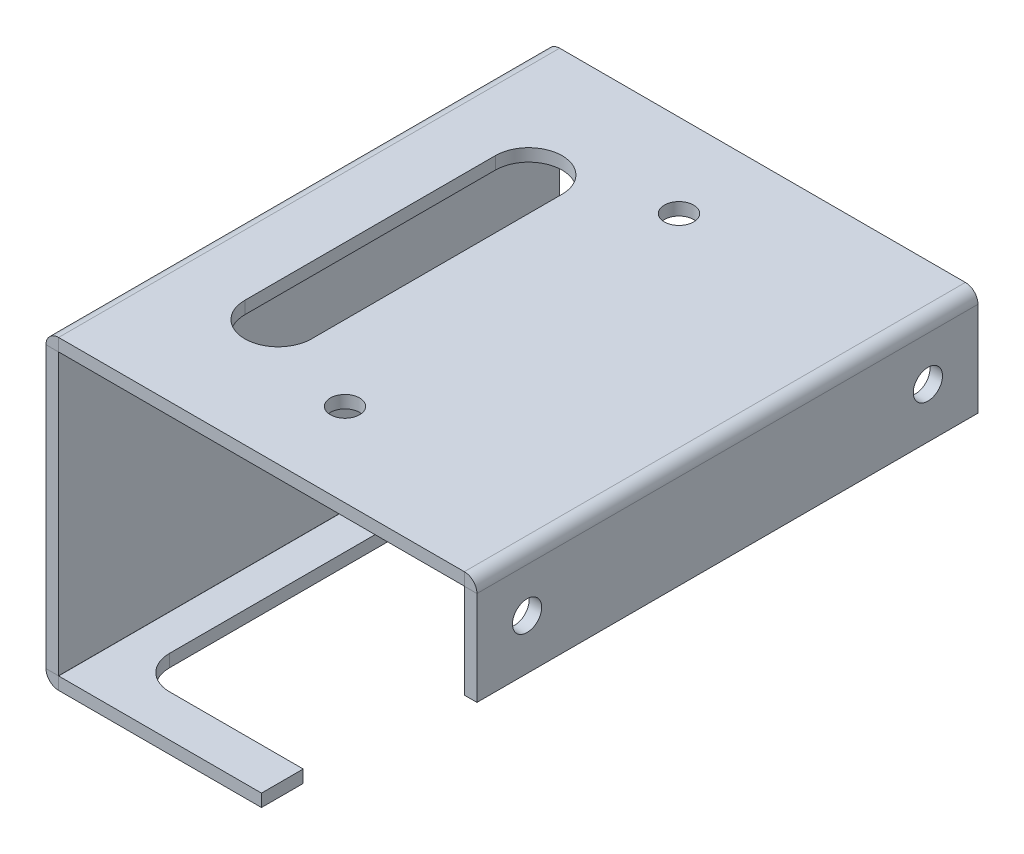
ISO-10303-21;
HEADER;
FILE_DESCRIPTION(('STEP AP214'),'2;1');
FILE_NAME('part.step','',(''),(''),'','','');
FILE_SCHEMA(('AUTOMOTIVE_DESIGN { 1 0 10303 214 1 1 1 1 }'));
ENDSEC;
DATA;
#1=APPLICATION_CONTEXT('core data for automotive mechanical design processes');
#2=APPLICATION_PROTOCOL_DEFINITION('international standard','automotive_design',2000,#1);
#3=PRODUCT_CONTEXT('',#1,'mechanical');
#4=PRODUCT('Part','Part','',(#3));
#5=PRODUCT_RELATED_PRODUCT_CATEGORY('part','',(#4));
#6=PRODUCT_DEFINITION_FORMATION('','',#4);
#7=PRODUCT_DEFINITION_CONTEXT('part definition',#1,'design');
#8=PRODUCT_DEFINITION('design','',#6,#7);
#9=PRODUCT_DEFINITION_SHAPE('','',#8);
#10=(LENGTH_UNIT() NAMED_UNIT(*) SI_UNIT(.MILLI.,.METRE.));
#11=(NAMED_UNIT(*) PLANE_ANGLE_UNIT() SI_UNIT($,.RADIAN.));
#12=(NAMED_UNIT(*) SI_UNIT($,.STERADIAN.) SOLID_ANGLE_UNIT());
#13=UNCERTAINTY_MEASURE_WITH_UNIT(LENGTH_MEASURE(1.E-05),#10,'distance_accuracy_value','');
#14=(GEOMETRIC_REPRESENTATION_CONTEXT(3) GLOBAL_UNCERTAINTY_ASSIGNED_CONTEXT((#13)) GLOBAL_UNIT_ASSIGNED_CONTEXT((#10,
#11,#12)) REPRESENTATION_CONTEXT('',''));
#15=CARTESIAN_POINT('',(0.,0.,0.));
#16=DIRECTION('',(0.,0.,1.));
#17=DIRECTION('',(1.,0.,0.));
#18=AXIS2_PLACEMENT_3D('',#15,#16,#17);
#19=CARTESIAN_POINT('',(59.1964656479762,-59.303534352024,-60.));
#20=DIRECTION('',(0.,0.,1.));
#21=DIRECTION('',(0.,1.,0.));
#22=AXIS2_PLACEMENT_3D('',#19,#20,#21);
#23=PLANE('',#22);
#24=DIRECTION('',(0.,-1.,0.));
#25=VECTOR('',#24,1.);
#26=CARTESIAN_POINT('',(60.6964656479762,-59.303534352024,-60.));
#27=LINE('',#26,#25);
#28=CARTESIAN_POINT('',(60.6964656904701,-0.0100000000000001,-60.));
#29=VERTEX_POINT('',#28);
#30=CARTESIAN_POINT('',(60.6964656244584,-33.597068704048,-60.));
#31=VERTEX_POINT('',#30);
#32=EDGE_CURVE('E474',#29,#31,#27,.T.);
#33=ORIENTED_EDGE('',*,*,#32,.T.);
#34=DIRECTION('',(-1.,0.,0.));
#35=VECTOR('',#34,1.);
#36=CARTESIAN_POINT('',(59.1964656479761,-33.597068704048,-60.));
#37=LINE('',#36,#35);
#38=CARTESIAN_POINT('',(59.1964656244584,-33.597068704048,-60.));
#39=VERTEX_POINT('',#38);
#40=EDGE_CURVE('E467',#31,#39,#37,.T.);
#41=ORIENTED_EDGE('',*,*,#40,.T.);
#42=DIRECTION('',(0.,-1.,0.));
#43=VECTOR('',#42,1.);
#44=CARTESIAN_POINT('',(59.1964656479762,-59.303534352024,-60.));
#45=LINE('',#44,#43);
#46=CARTESIAN_POINT('',(59.196465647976,-0.0100000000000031,-60.));
#47=VERTEX_POINT('',#46);
#48=EDGE_CURVE('E459',#47,#39,#45,.T.);
#49=ORIENTED_EDGE('',*,*,#48,.F.);
#50=DIRECTION('',(-1.,0.,0.));
#51=VECTOR('',#50,1.);
#52=CARTESIAN_POINT('',(59.196465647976,-0.00999999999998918,-60.));
#53=LINE('',#52,#51);
#54=EDGE_CURVE('E463',#29,#47,#53,.T.);
#55=ORIENTED_EDGE('',*,*,#54,.F.);
#56=EDGE_LOOP('',(#33,#41,#49,#55));
#57=FACE_BOUND('',#56,.T.);
#58=ADVANCED_FACE('F46',(#57),#23,.F.);
#59=CARTESIAN_POINT('',(59.1964656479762,-59.303534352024,0.));
#60=DIRECTION('',(0.,0.,-1.));
#61=DIRECTION('',(0.,-1.,0.));
#62=AXIS2_PLACEMENT_3D('',#59,#60,#61);
#63=PLANE('',#62);
#64=DIRECTION('',(0.,1.,0.));
#65=VECTOR('',#64,1.);
#66=CARTESIAN_POINT('',(59.1964656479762,-59.303534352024,0.));
#67=LINE('',#66,#65);
#68=CARTESIAN_POINT('',(59.1964656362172,-33.597068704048,0.));
#69=VERTEX_POINT('',#68);
#70=CARTESIAN_POINT('',(59.1964656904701,-0.0100000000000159,0.));
#71=VERTEX_POINT('',#70);
#72=EDGE_CURVE('E50',#69,#71,#67,.T.);
#73=ORIENTED_EDGE('',*,*,#72,.F.);
#74=DIRECTION('',(1.,0.,0.));
#75=VECTOR('',#74,1.);
#76=CARTESIAN_POINT('',(59.1964656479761,-33.597068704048,0.));
#77=LINE('',#76,#75);
#78=CARTESIAN_POINT('',(60.6964656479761,-33.597068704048,0.));
#79=VERTEX_POINT('',#78);
#80=EDGE_CURVE('E12',#69,#79,#77,.T.);
#81=ORIENTED_EDGE('',*,*,#80,.T.);
#82=DIRECTION('',(0.,1.,0.));
#83=VECTOR('',#82,1.);
#84=CARTESIAN_POINT('',(60.6964656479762,-59.303534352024,0.));
#85=LINE('',#84,#83);
#86=CARTESIAN_POINT('',(60.6964656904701,-0.0100000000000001,0.));
#87=VERTEX_POINT('',#86);
#88=EDGE_CURVE('E328',#79,#87,#85,.T.);
#89=ORIENTED_EDGE('',*,*,#88,.T.);
#90=DIRECTION('',(1.,0.,0.));
#91=VECTOR('',#90,1.);
#92=CARTESIAN_POINT('',(59.196465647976,-0.00999999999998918,0.));
#93=LINE('',#92,#91);
#94=EDGE_CURVE('E458',#71,#87,#93,.T.);
#95=ORIENTED_EDGE('',*,*,#94,.F.);
#96=EDGE_LOOP('',(#73,#81,#89,#95));
#97=FACE_BOUND('',#96,.T.);
#98=ADVANCED_FACE('F48',(#97),#63,.F.);
#99=CARTESIAN_POINT('',(60.6964656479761,-43.303534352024,-9.));
#100=DIRECTION('',(-1.,0.,0.));
#101=DIRECTION('',(0.,0.,1.));
#102=AXIS2_PLACEMENT_3D('',#99,#100,#101);
#103=PLANE('',#102);
#104=ORIENTED_EDGE('',*,*,#88,.F.);
#105=DIRECTION('',(0.,0.,-1.));
#106=VECTOR('',#105,1.);
#107=CARTESIAN_POINT('',(60.6964656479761,-33.597068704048,-9.));
#108=LINE('',#107,#106);
#109=EDGE_CURVE('E55',#79,#31,#108,.T.);
#110=ORIENTED_EDGE('',*,*,#109,.T.);
#111=ORIENTED_EDGE('',*,*,#32,.F.);
#112=DIRECTION('',(0.,0.,-1.));
#113=VECTOR('',#112,1.);
#114=CARTESIAN_POINT('',(60.696465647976,-0.00999999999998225,-9.));
#115=LINE('',#114,#113);
#116=EDGE_CURVE('E461',#87,#29,#115,.T.);
#117=ORIENTED_EDGE('',*,*,#116,.F.);
#118=EDGE_LOOP('',(#104,#110,#111,#117));
#119=FACE_BOUND('',#118,.T.);
#120=ADVANCED_FACE('F576',(#119),#103,.F.);
#121=CARTESIAN_POINT('',(59.1964656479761,-43.303534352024,-9.));
#122=DIRECTION('',(-1.,0.,0.));
#123=DIRECTION('',(0.,0.,1.));
#124=AXIS2_PLACEMENT_3D('',#121,#122,#123);
#125=PLANE('',#124);
#126=DIRECTION('',(0.,0.,-1.));
#127=VECTOR('',#126,1.);
#128=CARTESIAN_POINT('',(59.1964656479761,-33.597068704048,-9.));
#129=LINE('',#128,#127);
#130=EDGE_CURVE('E465',#69,#39,#129,.T.);
#131=ORIENTED_EDGE('',*,*,#130,.F.);
#132=ORIENTED_EDGE('',*,*,#72,.T.);
#133=DIRECTION('',(0.,0.,-1.));
#134=VECTOR('',#133,1.);
#135=CARTESIAN_POINT('',(59.196465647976,-0.00999999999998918,-9.));
#136=LINE('',#135,#134);
#137=EDGE_CURVE('E455',#71,#47,#136,.T.);
#138=ORIENTED_EDGE('',*,*,#137,.T.);
#139=ORIENTED_EDGE('',*,*,#48,.T.);
#140=EDGE_LOOP('',(#131,#132,#138,#139));
#141=FACE_BOUND('',#140,.T.);
#142=ADVANCED_FACE('F483',(#141),#125,.T.);
#143=CARTESIAN_POINT('',(110.803534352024,-5.30353435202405,-6.));
#144=DIRECTION('',(-1.,0.,0.));
#145=DIRECTION('',(0.,0.,-1.));
#146=AXIS2_PLACEMENT_3D('',#143,#144,#145);
#147=CYLINDRICAL_SURFACE('',#146,1.75);
#148=CARTESIAN_POINT('',(110.803534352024,-5.30353435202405,-6.));
#149=DIRECTION('',(1.,0.,0.));
#150=DIRECTION('',(0.,0.,1.));
#151=AXIS2_PLACEMENT_3D('',#148,#149,#150);
#152=CIRCLE('',#151,1.75);
#153=CARTESIAN_POINT('',(110.803534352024,-5.30353435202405,-4.25000000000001));
#154=VERTEX_POINT('',#153);
#155=EDGE_CURVE('E451',#154,#154,#152,.T.);
#156=ORIENTED_EDGE('',*,*,#155,.T.);
#157=EDGE_LOOP('',(#156));
#158=FACE_BOUND('',#157,.T.);
#159=CARTESIAN_POINT('',(109.303534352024,-5.30353435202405,-6.));
#160=DIRECTION('',(1.,0.,0.));
#161=DIRECTION('',(0.,0.,1.));
#162=AXIS2_PLACEMENT_3D('',#159,#160,#161);
#163=CIRCLE('',#162,1.75);
#164=CARTESIAN_POINT('',(109.303534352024,-5.30353435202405,-4.25000000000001));
#165=VERTEX_POINT('',#164);
#166=EDGE_CURVE('E433',#165,#165,#163,.T.);
#167=ORIENTED_EDGE('',*,*,#166,.F.);
#168=EDGE_LOOP('',(#167));
#169=FACE_BOUND('',#168,.T.);
#170=ADVANCED_FACE('F584',(#158,#169),#147,.F.);
#171=CARTESIAN_POINT('',(110.803534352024,-5.30353435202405,-54.));
#172=DIRECTION('',(-1.,0.,0.));
#173=DIRECTION('',(0.,0.,-1.));
#174=AXIS2_PLACEMENT_3D('',#171,#172,#173);
#175=CYLINDRICAL_SURFACE('',#174,1.75);
#176=CARTESIAN_POINT('',(110.803534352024,-5.30353435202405,-54.));
#177=DIRECTION('',(1.,0.,0.));
#178=DIRECTION('',(0.,0.,1.));
#179=AXIS2_PLACEMENT_3D('',#176,#177,#178);
#180=CIRCLE('',#179,1.75);
#181=CARTESIAN_POINT('',(110.803534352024,-5.30353435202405,-52.25));
#182=VERTEX_POINT('',#181);
#183=EDGE_CURVE('E448',#182,#182,#180,.T.);
#184=ORIENTED_EDGE('',*,*,#183,.T.);
#185=EDGE_LOOP('',(#184));
#186=FACE_BOUND('',#185,.T.);
#187=CARTESIAN_POINT('',(109.303534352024,-5.30353435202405,-54.));
#188=DIRECTION('',(1.,0.,0.));
#189=DIRECTION('',(0.,0.,1.));
#190=AXIS2_PLACEMENT_3D('',#187,#188,#189);
#191=CIRCLE('',#190,1.75);
#192=CARTESIAN_POINT('',(109.303534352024,-5.30353435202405,-52.25));
#193=VERTEX_POINT('',#192);
#194=EDGE_CURVE('E430',#193,#193,#191,.T.);
#195=ORIENTED_EDGE('',*,*,#194,.F.);
#196=EDGE_LOOP('',(#195));
#197=FACE_BOUND('',#196,.T.);
#198=ADVANCED_FACE('F588',(#186,#197),#175,.F.);
#199=CARTESIAN_POINT('',(110.803534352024,-11.303534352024,0.));
#200=DIRECTION('',(0.,1.,0.));
#201=DIRECTION('',(0.,0.,1.));
#202=AXIS2_PLACEMENT_3D('',#199,#200,#201);
#203=PLANE('',#202);
#204=DIRECTION('',(0.,0.,-1.));
#205=VECTOR('',#204,1.);
#206=CARTESIAN_POINT('',(109.303534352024,-11.303534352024,0.));
#207=LINE('',#206,#205);
#208=CARTESIAN_POINT('',(109.303534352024,-11.303534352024,0.));
#209=VERTEX_POINT('',#208);
#210=CARTESIAN_POINT('',(109.303534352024,-11.303534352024,-60.));
#211=VERTEX_POINT('',#210);
#212=EDGE_CURVE('E446',#209,#211,#207,.T.);
#213=ORIENTED_EDGE('',*,*,#212,.T.);
#214=DIRECTION('',(-1.,0.,0.));
#215=VECTOR('',#214,1.);
#216=CARTESIAN_POINT('',(110.803534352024,-11.303534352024,-60.));
#217=LINE('',#216,#215);
#218=CARTESIAN_POINT('',(110.803534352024,-11.303534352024,-60.));
#219=VERTEX_POINT('',#218);
#220=EDGE_CURVE('E436',#219,#211,#217,.T.);
#221=ORIENTED_EDGE('',*,*,#220,.F.);
#222=DIRECTION('',(0.,0.,-1.));
#223=VECTOR('',#222,1.);
#224=CARTESIAN_POINT('',(110.803534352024,-11.303534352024,0.));
#225=LINE('',#224,#223);
#226=CARTESIAN_POINT('',(110.803534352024,-11.303534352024,0.));
#227=VERTEX_POINT('',#226);
#228=EDGE_CURVE('E418',#227,#219,#225,.T.);
#229=ORIENTED_EDGE('',*,*,#228,.F.);
#230=DIRECTION('',(-1.,0.,0.));
#231=VECTOR('',#230,1.);
#232=CARTESIAN_POINT('',(110.803534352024,-11.303534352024,0.));
#233=LINE('',#232,#231);
#234=EDGE_CURVE('E443',#227,#209,#233,.T.);
#235=ORIENTED_EDGE('',*,*,#234,.T.);
#236=EDGE_LOOP('',(#213,#221,#229,#235));
#237=FACE_BOUND('',#236,.T.);
#238=ADVANCED_FACE('F594',(#237),#203,.F.);
#239=CARTESIAN_POINT('',(110.803534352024,110.696465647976,-60.));
#240=DIRECTION('',(0.,0.,1.));
#241=DIRECTION('',(0.,-1.,0.));
#242=AXIS2_PLACEMENT_3D('',#239,#240,#241);
#243=PLANE('',#242);
#244=DIRECTION('',(0.,1.,0.));
#245=VECTOR('',#244,1.);
#246=CARTESIAN_POINT('',(109.303534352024,110.696465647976,-60.));
#247=LINE('',#246,#245);
#248=CARTESIAN_POINT('',(109.303534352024,-0.01000000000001,-60.));
#249=VERTEX_POINT('',#248);
#250=EDGE_CURVE('E441',#211,#249,#247,.T.);
#251=ORIENTED_EDGE('',*,*,#250,.T.);
#252=DIRECTION('',(1.,0.,0.));
#253=VECTOR('',#252,1.);
#254=CARTESIAN_POINT('',(110.803534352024,-0.0100000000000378,-60.));
#255=LINE('',#254,#253);
#256=CARTESIAN_POINT('',(110.803534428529,-0.0100000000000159,-60.));
#257=VERTEX_POINT('',#256);
#258=EDGE_CURVE('E439',#249,#257,#255,.T.);
#259=ORIENTED_EDGE('',*,*,#258,.T.);
#260=DIRECTION('',(0.,1.,0.));
#261=VECTOR('',#260,1.);
#262=CARTESIAN_POINT('',(110.803534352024,110.696465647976,-60.));
#263=LINE('',#262,#261);
#264=EDGE_CURVE('E415',#219,#257,#263,.T.);
#265=ORIENTED_EDGE('',*,*,#264,.F.);
#266=ORIENTED_EDGE('',*,*,#220,.T.);
#267=EDGE_LOOP('',(#251,#259,#265,#266));
#268=FACE_BOUND('',#267,.T.);
#269=ADVANCED_FACE('F603',(#268),#243,.F.);
#270=CARTESIAN_POINT('',(109.303534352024,94.696465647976,-9.));
#271=DIRECTION('',(1.,0.,0.));
#272=DIRECTION('',(0.,0.,1.));
#273=AXIS2_PLACEMENT_3D('',#270,#271,#272);
#274=PLANE('',#273);
#275=ORIENTED_EDGE('',*,*,#166,.T.);
#276=EDGE_LOOP('',(#275));
#277=FACE_BOUND('',#276,.T.);
#278=ORIENTED_EDGE('',*,*,#194,.T.);
#279=EDGE_LOOP('',(#278));
#280=FACE_BOUND('',#279,.T.);
#281=DIRECTION('',(0.,-1.,0.));
#282=VECTOR('',#281,1.);
#283=CARTESIAN_POINT('',(109.303534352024,110.696465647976,0.));
#284=LINE('',#283,#282);
#285=CARTESIAN_POINT('',(109.303534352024,-0.01000000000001,0.));
#286=VERTEX_POINT('',#285);
#287=EDGE_CURVE('E422',#286,#209,#284,.T.);
#288=ORIENTED_EDGE('',*,*,#287,.F.);
#289=DIRECTION('',(0.,0.,-1.));
#290=VECTOR('',#289,1.);
#291=CARTESIAN_POINT('',(109.303534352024,-0.0100000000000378,-9.));
#292=LINE('',#291,#290);
#293=EDGE_CURVE('E427',#286,#249,#292,.T.);
#294=ORIENTED_EDGE('',*,*,#293,.T.);
#295=ORIENTED_EDGE('',*,*,#250,.F.);
#296=ORIENTED_EDGE('',*,*,#212,.F.);
#297=EDGE_LOOP('',(#288,#294,#295,#296));
#298=FACE_BOUND('',#297,.T.);
#299=ADVANCED_FACE('F607',(#277,#280,#298),#274,.F.);
#300=CARTESIAN_POINT('',(110.803534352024,110.696465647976,0.));
#301=DIRECTION('',(0.,0.,-1.));
#302=DIRECTION('',(0.,1.,0.));
#303=AXIS2_PLACEMENT_3D('',#300,#301,#302);
#304=PLANE('',#303);
#305=DIRECTION('',(0.,-1.,0.));
#306=VECTOR('',#305,1.);
#307=CARTESIAN_POINT('',(110.803534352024,110.696465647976,0.));
#308=LINE('',#307,#306);
#309=CARTESIAN_POINT('',(110.803534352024,-0.01000000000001,0.));
#310=VERTEX_POINT('',#309);
#311=EDGE_CURVE('E420',#310,#227,#308,.T.);
#312=ORIENTED_EDGE('',*,*,#311,.F.);
#313=DIRECTION('',(-1.,0.,0.));
#314=VECTOR('',#313,1.);
#315=CARTESIAN_POINT('',(110.803534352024,-0.0100000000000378,0.));
#316=LINE('',#315,#314);
#317=EDGE_CURVE('E424',#310,#286,#316,.T.);
#318=ORIENTED_EDGE('',*,*,#317,.T.);
#319=ORIENTED_EDGE('',*,*,#287,.T.);
#320=ORIENTED_EDGE('',*,*,#234,.F.);
#321=EDGE_LOOP('',(#312,#318,#319,#320));
#322=FACE_BOUND('',#321,.T.);
#323=ADVANCED_FACE('F611',(#322),#304,.F.);
#324=CARTESIAN_POINT('',(110.803534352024,94.696465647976,-9.));
#325=DIRECTION('',(1.,0.,0.));
#326=DIRECTION('',(0.,0.,1.));
#327=AXIS2_PLACEMENT_3D('',#324,#325,#326);
#328=PLANE('',#327);
#329=DIRECTION('',(0.,0.,-1.));
#330=VECTOR('',#329,1.);
#331=CARTESIAN_POINT('',(110.803534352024,-0.0100000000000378,-9.));
#332=LINE('',#331,#330);
#333=EDGE_CURVE('E372',#310,#257,#332,.T.);
#334=ORIENTED_EDGE('',*,*,#333,.F.);
#335=ORIENTED_EDGE('',*,*,#311,.T.);
#336=ORIENTED_EDGE('',*,*,#228,.T.);
#337=ORIENTED_EDGE('',*,*,#264,.T.);
#338=EDGE_LOOP('',(#334,#335,#336,#337));
#339=FACE_BOUND('',#338,.T.);
#340=ORIENTED_EDGE('',*,*,#183,.F.);
#341=EDGE_LOOP('',(#340));
#342=FACE_BOUND('',#341,.T.);
#343=ORIENTED_EDGE('',*,*,#155,.F.);
#344=EDGE_LOOP('',(#343));
#345=FACE_BOUND('',#344,.T.);
#346=ADVANCED_FACE('F615',(#339,#342,#345),#328,.T.);
#347=CARTESIAN_POINT('',(109.293534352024,-0.010000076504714,-60.));
#348=DIRECTION('',(0.,0.,-1.));
#349=DIRECTION('',(-1.,0.,0.));
#350=AXIS2_PLACEMENT_3D('',#347,#348,#349);
#351=PLANE('',#350);
#352=CARTESIAN_POINT('',(109.293534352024,-0.01,-60.));
#353=DIRECTION('',(0.,0.,-1.));
#354=DIRECTION('',(-1.,0.,0.));
#355=AXIS2_PLACEMENT_3D('',#352,#353,#354);
#356=CIRCLE('',#355,0.010000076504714);
#357=CARTESIAN_POINT('',(109.293534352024,0.,-60.));
#358=VERTEX_POINT('',#357);
#359=EDGE_CURVE('E412',#249,#358,#356,.F.);
#360=ORIENTED_EDGE('',*,*,#359,.T.);
#361=DIRECTION('',(0.,1.,0.));
#362=VECTOR('',#361,1.);
#363=CARTESIAN_POINT('',(109.293534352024,1.5,-60.));
#364=LINE('',#363,#362);
#365=CARTESIAN_POINT('',(109.293534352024,1.50000007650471,-60.));
#366=VERTEX_POINT('',#365);
#367=EDGE_CURVE('E409',#358,#366,#364,.T.);
#368=ORIENTED_EDGE('',*,*,#367,.T.);
#369=CARTESIAN_POINT('',(109.293534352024,-0.010000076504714,-60.));
#370=DIRECTION('',(0.,0.,1.));
#371=DIRECTION('',(1.,0.,0.));
#372=AXIS2_PLACEMENT_3D('',#369,#370,#371);
#373=CIRCLE('',#372,1.51000011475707);
#374=EDGE_CURVE('E369',#257,#366,#373,.T.);
#375=ORIENTED_EDGE('',*,*,#374,.F.);
#376=ORIENTED_EDGE('',*,*,#258,.F.);
#377=EDGE_LOOP('',(#360,#368,#375,#376));
#378=FACE_BOUND('',#377,.T.);
#379=ADVANCED_FACE('F619',(#378),#351,.T.);
#380=CARTESIAN_POINT('',(109.293534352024,-0.01,30.0353760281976));
#381=DIRECTION('',(0.,0.,-1.));
#382=DIRECTION('',(-1.,0.,0.));
#383=AXIS2_PLACEMENT_3D('',#380,#381,#382);
#384=CYLINDRICAL_SURFACE('',#383,0.010000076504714);
#385=ORIENTED_EDGE('',*,*,#293,.F.);
#386=CARTESIAN_POINT('',(109.293534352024,-0.01,0.));
#387=DIRECTION('',(0.,0.,-1.));
#388=DIRECTION('',(-1.,0.,0.));
#389=AXIS2_PLACEMENT_3D('',#386,#387,#388);
#390=CIRCLE('',#389,0.010000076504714);
#391=CARTESIAN_POINT('',(109.293534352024,0.,0.));
#392=VERTEX_POINT('',#391);
#393=EDGE_CURVE('E400',#392,#286,#390,.T.);
#394=ORIENTED_EDGE('',*,*,#393,.F.);
#395=DIRECTION('',(0.,0.,-1.));
#396=VECTOR('',#395,1.);
#397=CARTESIAN_POINT('',(109.293534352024,0.,-9.));
#398=LINE('',#397,#396);
#399=EDGE_CURVE('E406',#392,#358,#398,.T.);
#400=ORIENTED_EDGE('',*,*,#399,.T.);
#401=ORIENTED_EDGE('',*,*,#359,.F.);
#402=EDGE_LOOP('',(#385,#394,#400,#401));
#403=FACE_BOUND('',#402,.T.);
#404=ADVANCED_FACE('F623',(#403),#384,.F.);
#405=CARTESIAN_POINT('',(109.293534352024,-0.010000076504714,0.));
#406=DIRECTION('',(0.,0.,1.));
#407=DIRECTION('',(1.,0.,0.));
#408=AXIS2_PLACEMENT_3D('',#405,#406,#407);
#409=PLANE('',#408);
#410=DIRECTION('',(0.,-1.,0.));
#411=VECTOR('',#410,1.);
#412=CARTESIAN_POINT('',(109.293534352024,1.5,0.));
#413=LINE('',#412,#411);
#414=CARTESIAN_POINT('',(109.293534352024,1.5,0.));
#415=VERTEX_POINT('',#414);
#416=EDGE_CURVE('E403',#415,#392,#413,.T.);
#417=ORIENTED_EDGE('',*,*,#416,.T.);
#418=ORIENTED_EDGE('',*,*,#393,.T.);
#419=ORIENTED_EDGE('',*,*,#317,.F.);
#420=CARTESIAN_POINT('',(109.293534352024,-0.010000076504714,0.));
#421=DIRECTION('',(0.,0.,-1.));
#422=DIRECTION('',(-1.,0.,0.));
#423=AXIS2_PLACEMENT_3D('',#420,#421,#422);
#424=CIRCLE('',#423,1.51000011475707);
#425=EDGE_CURVE('E366',#415,#310,#424,.T.);
#426=ORIENTED_EDGE('',*,*,#425,.F.);
#427=EDGE_LOOP('',(#417,#418,#419,#426));
#428=FACE_BOUND('',#427,.T.);
#429=ADVANCED_FACE('F627',(#428),#409,.T.);
#430=CARTESIAN_POINT('',(85.,1.5,-10.));
#431=DIRECTION('',(0.,-1.,0.));
#432=DIRECTION('',(0.,0.,-1.));
#433=AXIS2_PLACEMENT_3D('',#430,#431,#432);
#434=CYLINDRICAL_SURFACE('',#433,1.75);
#435=CARTESIAN_POINT('',(85.,1.5,-10.));
#436=DIRECTION('',(0.,1.,0.));
#437=DIRECTION('',(0.,0.,1.));
#438=AXIS2_PLACEMENT_3D('',#435,#436,#437);
#439=CIRCLE('',#438,1.75);
#440=CARTESIAN_POINT('',(85.,1.5,-8.25000000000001));
#441=VERTEX_POINT('',#440);
#442=EDGE_CURVE('E397',#441,#441,#439,.T.);
#443=ORIENTED_EDGE('',*,*,#442,.T.);
#444=EDGE_LOOP('',(#443));
#445=FACE_BOUND('',#444,.T.);
#446=CARTESIAN_POINT('',(85.,0.,-10.));
#447=DIRECTION('',(0.,1.,0.));
#448=DIRECTION('',(0.,0.,1.));
#449=AXIS2_PLACEMENT_3D('',#446,#447,#448);
#450=CIRCLE('',#449,1.75);
#451=CARTESIAN_POINT('',(85.,0.,-8.25000000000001));
#452=VERTEX_POINT('',#451);
#453=EDGE_CURVE('E350',#452,#452,#450,.T.);
#454=ORIENTED_EDGE('',*,*,#453,.F.);
#455=EDGE_LOOP('',(#454));
#456=FACE_BOUND('',#455,.T.);
#457=ADVANCED_FACE('F631',(#445,#456),#434,.F.);
#458=CARTESIAN_POINT('',(72.,1.5,-15.));
#459=DIRECTION('',(0.,-1.,0.));
#460=DIRECTION('',(0.,0.,-1.));
#461=AXIS2_PLACEMENT_3D('',#458,#459,#460);
#462=CYLINDRICAL_SURFACE('',#461,4.);
#463=CARTESIAN_POINT('',(72.,0.,-15.));
#464=DIRECTION('',(0.,1.,0.));
#465=DIRECTION('',(0.,0.,1.));
#466=AXIS2_PLACEMENT_3D('',#463,#464,#465);
#467=CIRCLE('',#466,4.);
#468=CARTESIAN_POINT('',(68.,0.,-15.));
#469=VERTEX_POINT('',#468);
#470=CARTESIAN_POINT('',(76.,0.,-15.));
#471=VERTEX_POINT('',#470);
#472=EDGE_CURVE('E341',#469,#471,#467,.T.);
#473=ORIENTED_EDGE('',*,*,#472,.F.);
#474=DIRECTION('',(0.,-1.,0.));
#475=VECTOR('',#474,1.);
#476=CARTESIAN_POINT('',(68.,1.5,-15.));
#477=LINE('',#476,#475);
#478=CARTESIAN_POINT('',(68.,1.5,-15.));
#479=VERTEX_POINT('',#478);
#480=EDGE_CURVE('E378',#479,#469,#477,.T.);
#481=ORIENTED_EDGE('',*,*,#480,.F.);
#482=CARTESIAN_POINT('',(72.,1.5,-15.));
#483=DIRECTION('',(0.,1.,0.));
#484=DIRECTION('',(0.,0.,1.));
#485=AXIS2_PLACEMENT_3D('',#482,#483,#484);
#486=CIRCLE('',#485,4.);
#487=CARTESIAN_POINT('',(76.,1.5,-15.));
#488=VERTEX_POINT('',#487);
#489=EDGE_CURVE('E394',#479,#488,#486,.T.);
#490=ORIENTED_EDGE('',*,*,#489,.T.);
#491=DIRECTION('',(0.,-1.,0.));
#492=VECTOR('',#491,1.);
#493=CARTESIAN_POINT('',(76.,1.5,-15.));
#494=LINE('',#493,#492);
#495=EDGE_CURVE('E392',#488,#471,#494,.T.);
#496=ORIENTED_EDGE('',*,*,#495,.T.);
#497=EDGE_LOOP('',(#473,#481,#490,#496));
#498=FACE_BOUND('',#497,.T.);
#499=ADVANCED_FACE('F635',(#498),#462,.F.);
#500=CARTESIAN_POINT('',(76.,1.5,-45.));
#501=DIRECTION('',(-1.,0.,0.));
#502=DIRECTION('',(0.,0.,1.));
#503=AXIS2_PLACEMENT_3D('',#500,#501,#502);
#504=PLANE('',#503);
#505=DIRECTION('',(0.,0.,-1.));
#506=VECTOR('',#505,1.);
#507=CARTESIAN_POINT('',(76.,0.,-45.));
#508=LINE('',#507,#506);
#509=CARTESIAN_POINT('',(76.,0.,-45.));
#510=VERTEX_POINT('',#509);
#511=EDGE_CURVE('E338',#471,#510,#508,.T.);
#512=ORIENTED_EDGE('',*,*,#511,.F.);
#513=ORIENTED_EDGE('',*,*,#495,.F.);
#514=DIRECTION('',(0.,0.,-1.));
#515=VECTOR('',#514,1.);
#516=CARTESIAN_POINT('',(76.,1.5,-45.));
#517=LINE('',#516,#515);
#518=CARTESIAN_POINT('',(76.,1.5,-45.));
#519=VERTEX_POINT('',#518);
#520=EDGE_CURVE('E390',#488,#519,#517,.T.);
#521=ORIENTED_EDGE('',*,*,#520,.T.);
#522=DIRECTION('',(0.,-1.,0.));
#523=VECTOR('',#522,1.);
#524=CARTESIAN_POINT('',(76.,1.5,-45.));
#525=LINE('',#524,#523);
#526=EDGE_CURVE('E387',#519,#510,#525,.T.);
#527=ORIENTED_EDGE('',*,*,#526,.T.);
#528=EDGE_LOOP('',(#512,#513,#521,#527));
#529=FACE_BOUND('',#528,.T.);
#530=ADVANCED_FACE('F639',(#529),#504,.T.);
#531=CARTESIAN_POINT('',(72.,1.5,-45.));
#532=DIRECTION('',(0.,-1.,0.));
#533=DIRECTION('',(0.,0.,-1.));
#534=AXIS2_PLACEMENT_3D('',#531,#532,#533);
#535=CYLINDRICAL_SURFACE('',#534,4.);
#536=CARTESIAN_POINT('',(72.,0.,-45.));
#537=DIRECTION('',(0.,1.,0.));
#538=DIRECTION('',(0.,0.,1.));
#539=AXIS2_PLACEMENT_3D('',#536,#537,#538);
#540=CIRCLE('',#539,4.);
#541=CARTESIAN_POINT('',(68.,0.,-45.));
#542=VERTEX_POINT('',#541);
#543=EDGE_CURVE('E347',#510,#542,#540,.T.);
#544=ORIENTED_EDGE('',*,*,#543,.F.);
#545=ORIENTED_EDGE('',*,*,#526,.F.);
#546=CARTESIAN_POINT('',(72.,1.5,-45.));
#547=DIRECTION('',(0.,1.,0.));
#548=DIRECTION('',(0.,0.,1.));
#549=AXIS2_PLACEMENT_3D('',#546,#547,#548);
#550=CIRCLE('',#549,4.);
#551=CARTESIAN_POINT('',(68.,1.5,-45.));
#552=VERTEX_POINT('',#551);
#553=EDGE_CURVE('E385',#519,#552,#550,.T.);
#554=ORIENTED_EDGE('',*,*,#553,.T.);
#555=DIRECTION('',(0.,-1.,0.));
#556=VECTOR('',#555,1.);
#557=CARTESIAN_POINT('',(68.,1.5,-45.));
#558=LINE('',#557,#556);
#559=EDGE_CURVE('E382',#552,#542,#558,.T.);
#560=ORIENTED_EDGE('',*,*,#559,.T.);
#561=EDGE_LOOP('',(#544,#545,#554,#560));
#562=FACE_BOUND('',#561,.T.);
#563=ADVANCED_FACE('F643',(#562),#535,.F.);
#564=CARTESIAN_POINT('',(68.,1.5,-15.));
#565=DIRECTION('',(1.,0.,0.));
#566=DIRECTION('',(0.,0.,-1.));
#567=AXIS2_PLACEMENT_3D('',#564,#565,#566);
#568=PLANE('',#567);
#569=DIRECTION('',(0.,0.,1.));
#570=VECTOR('',#569,1.);
#571=CARTESIAN_POINT('',(68.,0.,-15.));
#572=LINE('',#571,#570);
#573=EDGE_CURVE('E344',#542,#469,#572,.T.);
#574=ORIENTED_EDGE('',*,*,#573,.F.);
#575=ORIENTED_EDGE('',*,*,#559,.F.);
#576=DIRECTION('',(0.,0.,1.));
#577=VECTOR('',#576,1.);
#578=CARTESIAN_POINT('',(68.,1.5,-15.));
#579=LINE('',#578,#577);
#580=EDGE_CURVE('E380',#552,#479,#579,.T.);
#581=ORIENTED_EDGE('',*,*,#580,.T.);
#582=ORIENTED_EDGE('',*,*,#480,.T.);
#583=EDGE_LOOP('',(#574,#575,#581,#582));
#584=FACE_BOUND('',#583,.T.);
#585=ADVANCED_FACE('F647',(#584),#568,.T.);
#586=CARTESIAN_POINT('',(85.,1.5,-50.));
#587=DIRECTION('',(0.,-1.,0.));
#588=DIRECTION('',(0.,0.,-1.));
#589=AXIS2_PLACEMENT_3D('',#586,#587,#588);
#590=CYLINDRICAL_SURFACE('',#589,1.75);
#591=CARTESIAN_POINT('',(85.,1.5,-50.));
#592=DIRECTION('',(0.,1.,0.));
#593=DIRECTION('',(0.,0.,1.));
#594=AXIS2_PLACEMENT_3D('',#591,#592,#593);
#595=CIRCLE('',#594,1.75);
#596=CARTESIAN_POINT('',(85.,1.5,-48.25));
#597=VERTEX_POINT('',#596);
#598=EDGE_CURVE('E375',#597,#597,#595,.T.);
#599=ORIENTED_EDGE('',*,*,#598,.T.);
#600=EDGE_LOOP('',(#599));
#601=FACE_BOUND('',#600,.T.);
#602=CARTESIAN_POINT('',(85.,0.,-50.));
#603=DIRECTION('',(0.,1.,0.));
#604=DIRECTION('',(0.,0.,1.));
#605=AXIS2_PLACEMENT_3D('',#602,#603,#604);
#606=CIRCLE('',#605,1.75);
#607=CARTESIAN_POINT('',(85.,0.,-48.25));
#608=VERTEX_POINT('',#607);
#609=EDGE_CURVE('E335',#608,#608,#606,.T.);
#610=ORIENTED_EDGE('',*,*,#609,.F.);
#611=EDGE_LOOP('',(#610));
#612=FACE_BOUND('',#611,.T.);
#613=ADVANCED_FACE('F651',(#601,#612),#590,.F.);
#614=CARTESIAN_POINT('',(109.293534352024,-0.01,30.0353760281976));
#615=DIRECTION('',(0.,0.,-1.));
#616=DIRECTION('',(-1.,0.,0.));
#617=AXIS2_PLACEMENT_3D('',#614,#615,#616);
#618=CYLINDRICAL_SURFACE('',#617,1.51000007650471);
#619=ORIENTED_EDGE('',*,*,#333,.T.);
#620=ORIENTED_EDGE('',*,*,#374,.T.);
#621=DIRECTION('',(0.,0.,-1.));
#622=VECTOR('',#621,1.);
#623=CARTESIAN_POINT('',(109.293534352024,1.5,-9.));
#624=LINE('',#623,#622);
#625=EDGE_CURVE('E361',#415,#366,#624,.T.);
#626=ORIENTED_EDGE('',*,*,#625,.F.);
#627=ORIENTED_EDGE('',*,*,#425,.T.);
#628=EDGE_LOOP('',(#619,#620,#626,#627));
#629=FACE_BOUND('',#628,.T.);
#630=ADVANCED_FACE('F655',(#629),#618,.T.);
#631=CARTESIAN_POINT('',(16.,1.5,-9.));
#632=DIRECTION('',(0.,1.,0.));
#633=DIRECTION('',(0.,0.,1.));
#634=AXIS2_PLACEMENT_3D('',#631,#632,#633);
#635=PLANE('',#634);
#636=DIRECTION('',(0.,0.,-1.));
#637=VECTOR('',#636,1.);
#638=CARTESIAN_POINT('',(60.706465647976,1.5,-9.));
#639=LINE('',#638,#637);
#640=CARTESIAN_POINT('',(60.706465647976,1.49999997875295,0.));
#641=VERTEX_POINT('',#640);
#642=CARTESIAN_POINT('',(60.706465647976,1.4999999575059,-60.));
#643=VERTEX_POINT('',#642);
#644=EDGE_CURVE('E324',#641,#643,#639,.T.);
#645=ORIENTED_EDGE('',*,*,#644,.F.);
#646=DIRECTION('',(1.,0.,0.));
#647=VECTOR('',#646,1.);
#648=CARTESIAN_POINT('',(0.,1.5,0.));
#649=LINE('',#648,#647);
#650=EDGE_CURVE('E364',#641,#415,#649,.T.);
#651=ORIENTED_EDGE('',*,*,#650,.T.);
#652=ORIENTED_EDGE('',*,*,#625,.T.);
#653=DIRECTION('',(-1.,0.,0.));
#654=VECTOR('',#653,1.);
#655=CARTESIAN_POINT('',(0.,1.5,-60.));
#656=LINE('',#655,#654);
#657=EDGE_CURVE('E358',#366,#643,#656,.T.);
#658=ORIENTED_EDGE('',*,*,#657,.T.);
#659=EDGE_LOOP('',(#645,#651,#652,#658));
#660=FACE_BOUND('',#659,.T.);
#661=ORIENTED_EDGE('',*,*,#598,.F.);
#662=EDGE_LOOP('',(#661));
#663=FACE_BOUND('',#662,.T.);
#664=ORIENTED_EDGE('',*,*,#580,.F.);
#665=ORIENTED_EDGE('',*,*,#553,.F.);
#666=ORIENTED_EDGE('',*,*,#520,.F.);
#667=ORIENTED_EDGE('',*,*,#489,.F.);
#668=EDGE_LOOP('',(#664,#665,#666,#667));
#669=FACE_BOUND('',#668,.T.);
#670=ORIENTED_EDGE('',*,*,#442,.F.);
#671=EDGE_LOOP('',(#670));
#672=FACE_BOUND('',#671,.T.);
#673=ADVANCED_FACE('F506',(#660,#663,#669,#672),#635,.T.);
#674=CARTESIAN_POINT('',(0.,1.5,0.));
#675=DIRECTION('',(0.,0.,-1.));
#676=DIRECTION('',(-1.,0.,0.));
#677=AXIS2_PLACEMENT_3D('',#674,#675,#676);
#678=PLANE('',#677);
#679=ORIENTED_EDGE('',*,*,#650,.F.);
#680=DIRECTION('',(0.,-1.,0.));
#681=VECTOR('',#680,1.);
#682=CARTESIAN_POINT('',(60.706465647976,1.5,0.));
#683=LINE('',#682,#681);
#684=CARTESIAN_POINT('',(60.706465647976,0.,0.));
#685=VERTEX_POINT('',#684);
#686=EDGE_CURVE('E355',#641,#685,#683,.T.);
#687=ORIENTED_EDGE('',*,*,#686,.T.);
#688=DIRECTION('',(1.,0.,0.));
#689=VECTOR('',#688,1.);
#690=CARTESIAN_POINT('',(0.,0.,0.));
#691=LINE('',#690,#689);
#692=EDGE_CURVE('E353',#685,#392,#691,.T.);
#693=ORIENTED_EDGE('',*,*,#692,.T.);
#694=ORIENTED_EDGE('',*,*,#416,.F.);
#695=EDGE_LOOP('',(#679,#687,#693,#694));
#696=FACE_BOUND('',#695,.T.);
#697=ADVANCED_FACE('F502',(#696),#678,.F.);
#698=CARTESIAN_POINT('',(16.,0.,-9.));
#699=DIRECTION('',(0.,1.,0.));
#700=DIRECTION('',(0.,0.,1.));
#701=AXIS2_PLACEMENT_3D('',#698,#699,#700);
#702=PLANE('',#701);
#703=ORIENTED_EDGE('',*,*,#453,.T.);
#704=EDGE_LOOP('',(#703));
#705=FACE_BOUND('',#704,.T.);
#706=ORIENTED_EDGE('',*,*,#543,.T.);
#707=ORIENTED_EDGE('',*,*,#573,.T.);
#708=ORIENTED_EDGE('',*,*,#472,.T.);
#709=ORIENTED_EDGE('',*,*,#511,.T.);
#710=EDGE_LOOP('',(#706,#707,#708,#709));
#711=FACE_BOUND('',#710,.T.);
#712=ORIENTED_EDGE('',*,*,#609,.T.);
#713=EDGE_LOOP('',(#712));
#714=FACE_BOUND('',#713,.T.);
#715=ORIENTED_EDGE('',*,*,#692,.F.);
#716=DIRECTION('',(0.,0.,-1.));
#717=VECTOR('',#716,1.);
#718=CARTESIAN_POINT('',(60.706465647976,0.,-9.));
#719=LINE('',#718,#717);
#720=CARTESIAN_POINT('',(60.706465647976,-4.2494103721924E-08,-60.));
#721=VERTEX_POINT('',#720);
#722=EDGE_CURVE('E332',#685,#721,#719,.T.);
#723=ORIENTED_EDGE('',*,*,#722,.T.);
#724=DIRECTION('',(-1.,0.,0.));
#725=VECTOR('',#724,1.);
#726=CARTESIAN_POINT('',(0.,0.,-60.));
#727=LINE('',#726,#725);
#728=EDGE_CURVE('E329',#358,#721,#727,.T.);
#729=ORIENTED_EDGE('',*,*,#728,.F.);
#730=ORIENTED_EDGE('',*,*,#399,.F.);
#731=EDGE_LOOP('',(#715,#723,#729,#730));
#732=FACE_BOUND('',#731,.T.);
#733=ADVANCED_FACE('F498',(#705,#711,#714,#732),#702,.F.);
#734=CARTESIAN_POINT('',(0.,1.5,-60.));
#735=DIRECTION('',(0.,0.,1.));
#736=DIRECTION('',(1.,0.,0.));
#737=AXIS2_PLACEMENT_3D('',#734,#735,#736);
#738=PLANE('',#737);
#739=ORIENTED_EDGE('',*,*,#728,.T.);
#740=DIRECTION('',(0.,1.,0.));
#741=VECTOR('',#740,1.);
#742=CARTESIAN_POINT('',(60.706465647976,1.5,-60.));
#743=LINE('',#742,#741);
#744=EDGE_CURVE('E325',#721,#643,#743,.T.);
#745=ORIENTED_EDGE('',*,*,#744,.T.);
#746=ORIENTED_EDGE('',*,*,#657,.F.);
#747=ORIENTED_EDGE('',*,*,#367,.F.);
#748=EDGE_LOOP('',(#739,#745,#746,#747));
#749=FACE_BOUND('',#748,.T.);
#750=ADVANCED_FACE('F511',(#749),#738,.F.);
#751=CARTESIAN_POINT('',(60.706465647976,-0.0099999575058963,0.));
#752=DIRECTION('',(0.,0.,1.));
#753=DIRECTION('',(1.,0.,0.));
#754=AXIS2_PLACEMENT_3D('',#751,#752,#753);
#755=PLANE('',#754);
#756=ORIENTED_EDGE('',*,*,#94,.T.);
#757=CARTESIAN_POINT('',(60.706465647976,-0.01,0.));
#758=DIRECTION('',(0.,0.,1.));
#759=DIRECTION('',(1.,0.,0.));
#760=AXIS2_PLACEMENT_3D('',#757,#758,#759);
#761=CIRCLE('',#760,0.0099999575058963);
#762=EDGE_CURVE('E315',#87,#685,#761,.F.);
#763=ORIENTED_EDGE('',*,*,#762,.T.);
#764=ORIENTED_EDGE('',*,*,#686,.F.);
#765=CARTESIAN_POINT('',(60.706465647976,-0.0099999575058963,0.));
#766=DIRECTION('',(0.,0.,-1.));
#767=DIRECTION('',(-1.,0.,0.));
#768=AXIS2_PLACEMENT_3D('',#765,#766,#767);
#769=CIRCLE('',#768,1.50999993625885);
#770=EDGE_CURVE('E320',#71,#641,#769,.T.);
#771=ORIENTED_EDGE('',*,*,#770,.F.);
#772=EDGE_LOOP('',(#756,#763,#764,#771));
#773=FACE_BOUND('',#772,.T.);
#774=ADVANCED_FACE('F490',(#773),#755,.T.);
#775=CARTESIAN_POINT('',(60.706465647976,-0.0099999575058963,-60.));
#776=DIRECTION('',(0.,0.,-1.));
#777=DIRECTION('',(-1.,0.,0.));
#778=AXIS2_PLACEMENT_3D('',#775,#776,#777);
#779=PLANE('',#778);
#780=CARTESIAN_POINT('',(60.706465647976,-0.01,-60.));
#781=DIRECTION('',(0.,0.,1.));
#782=DIRECTION('',(1.,0.,0.));
#783=AXIS2_PLACEMENT_3D('',#780,#781,#782);
#784=CIRCLE('',#783,0.0099999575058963);
#785=EDGE_CURVE('E317',#721,#29,#784,.T.);
#786=ORIENTED_EDGE('',*,*,#785,.T.);
#787=ORIENTED_EDGE('',*,*,#54,.T.);
#788=CARTESIAN_POINT('',(60.706465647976,-0.0099999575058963,-60.));
#789=DIRECTION('',(0.,0.,1.));
#790=DIRECTION('',(1.,0.,0.));
#791=AXIS2_PLACEMENT_3D('',#788,#789,#790);
#792=CIRCLE('',#791,1.50999993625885);
#793=EDGE_CURVE('E71',#643,#47,#792,.T.);
#794=ORIENTED_EDGE('',*,*,#793,.F.);
#795=ORIENTED_EDGE('',*,*,#744,.F.);
#796=EDGE_LOOP('',(#786,#787,#794,#795));
#797=FACE_BOUND('',#796,.T.);
#798=ADVANCED_FACE('F513',(#797),#779,.T.);
#799=CARTESIAN_POINT('',(60.706465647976,-0.01,-90.0353760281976));
#800=DIRECTION('',(0.,0.,1.));
#801=DIRECTION('',(1.,0.,0.));
#802=AXIS2_PLACEMENT_3D('',#799,#800,#801);
#803=CYLINDRICAL_SURFACE('',#802,1.5099999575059);
#804=ORIENTED_EDGE('',*,*,#644,.T.);
#805=ORIENTED_EDGE('',*,*,#793,.T.);
#806=ORIENTED_EDGE('',*,*,#137,.F.);
#807=ORIENTED_EDGE('',*,*,#770,.T.);
#808=EDGE_LOOP('',(#804,#805,#806,#807));
#809=FACE_BOUND('',#808,.T.);
#810=ADVANCED_FACE('F504',(#809),#803,.T.);
#811=CARTESIAN_POINT('',(60.706465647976,-0.01,-90.0353760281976));
#812=DIRECTION('',(0.,0.,1.));
#813=DIRECTION('',(1.,0.,0.));
#814=AXIS2_PLACEMENT_3D('',#811,#812,#813);
#815=CYLINDRICAL_SURFACE('',#814,0.0099999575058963);
#816=ORIENTED_EDGE('',*,*,#722,.F.);
#817=ORIENTED_EDGE('',*,*,#762,.F.);
#818=ORIENTED_EDGE('',*,*,#116,.T.);
#819=ORIENTED_EDGE('',*,*,#785,.F.);
#820=EDGE_LOOP('',(#816,#817,#818,#819));
#821=FACE_BOUND('',#820,.T.);
#822=ADVANCED_FACE('F493',(#821),#815,.F.);
#823=CARTESIAN_POINT('',(60.7064656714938,-33.597068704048,0.));
#824=DIRECTION('',(0.,0.,1.));
#825=DIRECTION('',(1.,0.,0.));
#826=AXIS2_PLACEMENT_3D('',#823,#824,#825);
#827=PLANE('',#826);
#828=DIRECTION('',(0.,1.,0.));
#829=VECTOR('',#828,1.);
#830=CARTESIAN_POINT('',(60.7064656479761,-35.107068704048,0.));
#831=LINE('',#830,#829);
#832=CARTESIAN_POINT('',(60.7064656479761,-35.1070687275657,0.));
#833=VERTEX_POINT('',#832);
#834=CARTESIAN_POINT('',(60.7064656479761,-33.607068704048,0.));
#835=VERTEX_POINT('',#834);
#836=EDGE_CURVE('E228',#833,#835,#831,.T.);
#837=ORIENTED_EDGE('',*,*,#836,.T.);
#838=CARTESIAN_POINT('',(60.7064656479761,-33.597068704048,0.));
#839=DIRECTION('',(0.,0.,1.));
#840=DIRECTION('',(1.,0.,0.));
#841=AXIS2_PLACEMENT_3D('',#838,#839,#840);
#842=CIRCLE('',#841,0.0100000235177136);
#843=EDGE_CURVE('E63',#835,#79,#842,.F.);
#844=ORIENTED_EDGE('',*,*,#843,.T.);
#845=ORIENTED_EDGE('',*,*,#80,.F.);
#846=CARTESIAN_POINT('',(60.7064656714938,-33.597068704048,0.));
#847=DIRECTION('',(0.,0.,-1.));
#848=DIRECTION('',(-1.,0.,0.));
#849=AXIS2_PLACEMENT_3D('',#846,#847,#848);
#850=CIRCLE('',#849,1.51000003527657);
#851=EDGE_CURVE('E309',#833,#69,#850,.T.);
#852=ORIENTED_EDGE('',*,*,#851,.F.);
#853=EDGE_LOOP('',(#837,#844,#845,#852));
#854=FACE_BOUND('',#853,.T.);
#855=ADVANCED_FACE('F529',(#854),#827,.T.);
#856=CARTESIAN_POINT('',(60.7064656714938,-33.597068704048,-60.));
#857=DIRECTION('',(0.,0.,-1.));
#858=DIRECTION('',(-1.,0.,0.));
#859=AXIS2_PLACEMENT_3D('',#856,#857,#858);
#860=PLANE('',#859);
#861=CARTESIAN_POINT('',(60.7064656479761,-33.597068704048,-60.));
#862=DIRECTION('',(0.,0.,1.));
#863=DIRECTION('',(1.,0.,0.));
#864=AXIS2_PLACEMENT_3D('',#861,#862,#863);
#865=CIRCLE('',#864,0.0100000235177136);
#866=CARTESIAN_POINT('',(60.7064656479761,-33.607068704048,-60.));
#867=VERTEX_POINT('',#866);
#868=EDGE_CURVE('E306',#31,#867,#865,.T.);
#869=ORIENTED_EDGE('',*,*,#868,.T.);
#870=DIRECTION('',(0.,-1.,0.));
#871=VECTOR('',#870,1.);
#872=CARTESIAN_POINT('',(60.7064656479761,-35.107068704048,-60.));
#873=LINE('',#872,#871);
#874=CARTESIAN_POINT('',(60.7064656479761,-35.107068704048,-60.));
#875=VERTEX_POINT('',#874);
#876=EDGE_CURVE('E298',#867,#875,#873,.T.);
#877=ORIENTED_EDGE('',*,*,#876,.T.);
#878=CARTESIAN_POINT('',(60.7064656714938,-33.597068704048,-60.));
#879=DIRECTION('',(0.,0.,1.));
#880=DIRECTION('',(1.,0.,0.));
#881=AXIS2_PLACEMENT_3D('',#878,#879,#880);
#882=CIRCLE('',#881,1.51000003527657);
#883=EDGE_CURVE('E312',#39,#875,#882,.T.);
#884=ORIENTED_EDGE('',*,*,#883,.F.);
#885=ORIENTED_EDGE('',*,*,#40,.F.);
#886=EDGE_LOOP('',(#869,#877,#884,#885));
#887=FACE_BOUND('',#886,.T.);
#888=ADVANCED_FACE('F520',(#887),#860,.T.);
#889=CARTESIAN_POINT('',(60.7064656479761,-33.597068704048,-90.0353760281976));
#890=DIRECTION('',(0.,0.,1.));
#891=DIRECTION('',(1.,0.,0.));
#892=AXIS2_PLACEMENT_3D('',#889,#890,#891);
#893=CYLINDRICAL_SURFACE('',#892,1.51000002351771);
#894=ORIENTED_EDGE('',*,*,#130,.T.);
#895=ORIENTED_EDGE('',*,*,#883,.T.);
#896=DIRECTION('',(0.,0.,-1.));
#897=VECTOR('',#896,1.);
#898=CARTESIAN_POINT('',(60.7064656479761,-35.107068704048,-9.));
#899=LINE('',#898,#897);
#900=EDGE_CURVE('E231',#833,#875,#899,.T.);
#901=ORIENTED_EDGE('',*,*,#900,.F.);
#902=ORIENTED_EDGE('',*,*,#851,.T.);
#903=EDGE_LOOP('',(#894,#895,#901,#902));
#904=FACE_BOUND('',#903,.T.);
#905=ADVANCED_FACE('F531',(#904),#893,.T.);
#906=CARTESIAN_POINT('',(60.7064656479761,-33.597068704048,-90.0353760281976));
#907=DIRECTION('',(0.,0.,1.));
#908=DIRECTION('',(1.,0.,0.));
#909=AXIS2_PLACEMENT_3D('',#906,#907,#908);
#910=CYLINDRICAL_SURFACE('',#909,0.0100000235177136);
#911=ORIENTED_EDGE('',*,*,#109,.F.);
#912=ORIENTED_EDGE('',*,*,#843,.F.);
#913=DIRECTION('',(0.,0.,-1.));
#914=VECTOR('',#913,1.);
#915=CARTESIAN_POINT('',(60.7064656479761,-33.607068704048,-9.));
#916=LINE('',#915,#914);
#917=EDGE_CURVE('E301',#835,#867,#916,.T.);
#918=ORIENTED_EDGE('',*,*,#917,.T.);
#919=ORIENTED_EDGE('',*,*,#868,.F.);
#920=EDGE_LOOP('',(#911,#912,#918,#919));
#921=FACE_BOUND('',#920,.T.);
#922=ADVANCED_FACE('F522',(#921),#910,.F.);
#923=CARTESIAN_POINT('',(85.0000000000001,-35.1070687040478,0.));
#924=DIRECTION('',(-1.,0.,0.));
#925=DIRECTION('',(0.,0.,-1.));
#926=AXIS2_PLACEMENT_3D('',#923,#924,#925);
#927=PLANE('',#926);
#928=DIRECTION('',(0.,0.,1.));
#929=VECTOR('',#928,1.);
#930=CARTESIAN_POINT('',(85.0000000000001,-33.6070687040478,0.));
#931=LINE('',#930,#929);
#932=CARTESIAN_POINT('',(85.0000000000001,-33.6070687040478,-5.));
#933=VERTEX_POINT('',#932);
#934=CARTESIAN_POINT('',(85.0000000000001,-33.6070687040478,0.));
#935=VERTEX_POINT('',#934);
#936=EDGE_CURVE('E246',#933,#935,#931,.T.);
#937=ORIENTED_EDGE('',*,*,#936,.T.);
#938=DIRECTION('',(0.,1.,0.));
#939=VECTOR('',#938,1.);
#940=CARTESIAN_POINT('',(85.0000000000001,-35.1070687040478,0.));
#941=LINE('',#940,#939);
#942=CARTESIAN_POINT('',(85.0000000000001,-35.1070687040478,0.));
#943=VERTEX_POINT('',#942);
#944=EDGE_CURVE('E226',#943,#935,#941,.T.);
#945=ORIENTED_EDGE('',*,*,#944,.F.);
#946=DIRECTION('',(0.,0.,1.));
#947=VECTOR('',#946,1.);
#948=CARTESIAN_POINT('',(85.0000000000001,-35.1070687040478,0.));
#949=LINE('',#948,#947);
#950=CARTESIAN_POINT('',(85.0000000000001,-35.1070687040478,-5.));
#951=VERTEX_POINT('',#950);
#952=EDGE_CURVE('E235',#951,#943,#949,.T.);
#953=ORIENTED_EDGE('',*,*,#952,.F.);
#954=DIRECTION('',(0.,1.,0.));
#955=VECTOR('',#954,1.);
#956=CARTESIAN_POINT('',(85.0000000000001,-35.1070687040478,-5.));
#957=LINE('',#956,#955);
#958=EDGE_CURVE('E295',#951,#933,#957,.T.);
#959=ORIENTED_EDGE('',*,*,#958,.T.);
#960=EDGE_LOOP('',(#937,#945,#953,#959));
#961=FACE_BOUND('',#960,.T.);
#962=ADVANCED_FACE('F244',(#961),#927,.F.);
#963=CARTESIAN_POINT('',(85.0000000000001,-35.1070687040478,-5.));
#964=DIRECTION('',(0.,0.,1.));
#965=DIRECTION('',(-1.,0.,0.));
#966=AXIS2_PLACEMENT_3D('',#963,#964,#965);
#967=PLANE('',#966);
#968=DIRECTION('',(1.,0.,0.));
#969=VECTOR('',#968,1.);
#970=CARTESIAN_POINT('',(85.0000000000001,-33.6070687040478,-5.));
#971=LINE('',#970,#969);
#972=CARTESIAN_POINT('',(69.0000000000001,-33.6070687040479,-5.));
#973=VERTEX_POINT('',#972);
#974=EDGE_CURVE('E293',#973,#933,#971,.T.);
#975=ORIENTED_EDGE('',*,*,#974,.T.);
#976=ORIENTED_EDGE('',*,*,#958,.F.);
#977=DIRECTION('',(1.,0.,0.));
#978=VECTOR('',#977,1.);
#979=CARTESIAN_POINT('',(85.0000000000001,-35.1070687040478,-5.));
#980=LINE('',#979,#978);
#981=CARTESIAN_POINT('',(69.0000000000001,-35.1070687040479,-5.));
#982=VERTEX_POINT('',#981);
#983=EDGE_CURVE('E238',#982,#951,#980,.T.);
#984=ORIENTED_EDGE('',*,*,#983,.F.);
#985=DIRECTION('',(0.,1.,0.));
#986=VECTOR('',#985,1.);
#987=CARTESIAN_POINT('',(69.0000000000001,-35.1070687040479,-5.));
#988=LINE('',#987,#986);
#989=EDGE_CURVE('E290',#982,#973,#988,.T.);
#990=ORIENTED_EDGE('',*,*,#989,.T.);
#991=EDGE_LOOP('',(#975,#976,#984,#990));
#992=FACE_BOUND('',#991,.T.);
#993=ADVANCED_FACE('F562',(#992),#967,.F.);
#994=CARTESIAN_POINT('',(69.0000000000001,-35.1070687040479,-9.));
#995=DIRECTION('',(0.,1.,0.));
#996=DIRECTION('',(0.,0.,-1.));
#997=AXIS2_PLACEMENT_3D('',#994,#995,#996);
#998=CYLINDRICAL_SURFACE('',#997,4.);
#999=CARTESIAN_POINT('',(69.0000000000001,-33.6070687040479,-9.));
#1000=DIRECTION('',(0.,1.,0.));
#1001=DIRECTION('',(0.,0.,1.));
#1002=AXIS2_PLACEMENT_3D('',#999,#1000,#1001);
#1003=CIRCLE('',#1002,4.);
#1004=CARTESIAN_POINT('',(65.0000000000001,-33.6070687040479,-9.00000000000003));
#1005=VERTEX_POINT('',#1004);
#1006=EDGE_CURVE('E288',#1005,#973,#1003,.T.);
#1007=ORIENTED_EDGE('',*,*,#1006,.T.);
#1008=ORIENTED_EDGE('',*,*,#989,.F.);
#1009=CARTESIAN_POINT('',(69.0000000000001,-35.1070687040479,-9.));
#1010=DIRECTION('',(0.,1.,0.));
#1011=DIRECTION('',(0.,0.,1.));
#1012=AXIS2_PLACEMENT_3D('',#1009,#1010,#1011);
#1013=CIRCLE('',#1012,4.);
#1014=CARTESIAN_POINT('',(65.0000000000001,-35.1070687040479,-9.00000000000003));
#1015=VERTEX_POINT('',#1014);
#1016=EDGE_CURVE('E253',#1015,#982,#1013,.T.);
#1017=ORIENTED_EDGE('',*,*,#1016,.F.);
#1018=DIRECTION('',(0.,1.,0.));
#1019=VECTOR('',#1018,1.);
#1020=CARTESIAN_POINT('',(65.0000000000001,-35.1070687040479,-9.00000000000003));
#1021=LINE('',#1020,#1019);
#1022=EDGE_CURVE('E285',#1015,#1005,#1021,.T.);
#1023=ORIENTED_EDGE('',*,*,#1022,.T.);
#1024=EDGE_LOOP('',(#1007,#1008,#1017,#1023));
#1025=FACE_BOUND('',#1024,.T.);
#1026=ADVANCED_FACE('F558',(#1025),#998,.F.);
#1027=CARTESIAN_POINT('',(65.0000000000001,-35.1070687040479,-9.00000000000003));
#1028=DIRECTION('',(-1.,0.,0.));
#1029=DIRECTION('',(0.,0.,-1.));
#1030=AXIS2_PLACEMENT_3D('',#1027,#1028,#1029);
#1031=PLANE('',#1030);
#1032=DIRECTION('',(0.,0.,1.));
#1033=VECTOR('',#1032,1.);
#1034=CARTESIAN_POINT('',(65.0000000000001,-33.6070687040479,-9.00000000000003));
#1035=LINE('',#1034,#1033);
#1036=CARTESIAN_POINT('',(65.0000000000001,-33.6070687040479,-51.));
#1037=VERTEX_POINT('',#1036);
#1038=EDGE_CURVE('E283',#1037,#1005,#1035,.T.);
#1039=ORIENTED_EDGE('',*,*,#1038,.T.);
#1040=ORIENTED_EDGE('',*,*,#1022,.F.);
#1041=DIRECTION('',(0.,0.,1.));
#1042=VECTOR('',#1041,1.);
#1043=CARTESIAN_POINT('',(65.0000000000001,-35.1070687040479,-9.00000000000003));
#1044=LINE('',#1043,#1042);
#1045=CARTESIAN_POINT('',(65.0000000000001,-35.1070687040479,-51.));
#1046=VERTEX_POINT('',#1045);
#1047=EDGE_CURVE('E255',#1046,#1015,#1044,.T.);
#1048=ORIENTED_EDGE('',*,*,#1047,.F.);
#1049=DIRECTION('',(0.,1.,0.));
#1050=VECTOR('',#1049,1.);
#1051=CARTESIAN_POINT('',(65.0000000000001,-35.1070687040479,-51.));
#1052=LINE('',#1051,#1050);
#1053=EDGE_CURVE('E280',#1046,#1037,#1052,.T.);
#1054=ORIENTED_EDGE('',*,*,#1053,.T.);
#1055=EDGE_LOOP('',(#1039,#1040,#1048,#1054));
#1056=FACE_BOUND('',#1055,.T.);
#1057=ADVANCED_FACE('F554',(#1056),#1031,.F.);
#1058=CARTESIAN_POINT('',(69.0000000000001,-35.1070687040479,-51.));
#1059=DIRECTION('',(0.,1.,0.));
#1060=DIRECTION('',(0.,0.,-1.));
#1061=AXIS2_PLACEMENT_3D('',#1058,#1059,#1060);
#1062=CYLINDRICAL_SURFACE('',#1061,4.);
#1063=CARTESIAN_POINT('',(69.0000000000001,-33.6070687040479,-51.));
#1064=DIRECTION('',(0.,1.,0.));
#1065=DIRECTION('',(0.,0.,1.));
#1066=AXIS2_PLACEMENT_3D('',#1063,#1064,#1065);
#1067=CIRCLE('',#1066,4.);
#1068=CARTESIAN_POINT('',(69.0000000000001,-33.6070687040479,-55.));
#1069=VERTEX_POINT('',#1068);
#1070=EDGE_CURVE('E278',#1069,#1037,#1067,.T.);
#1071=ORIENTED_EDGE('',*,*,#1070,.T.);
#1072=ORIENTED_EDGE('',*,*,#1053,.F.);
#1073=CARTESIAN_POINT('',(69.0000000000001,-35.1070687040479,-51.));
#1074=DIRECTION('',(0.,1.,0.));
#1075=DIRECTION('',(0.,0.,1.));
#1076=AXIS2_PLACEMENT_3D('',#1073,#1074,#1075);
#1077=CIRCLE('',#1076,4.);
#1078=CARTESIAN_POINT('',(69.0000000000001,-35.1070687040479,-55.));
#1079=VERTEX_POINT('',#1078);
#1080=EDGE_CURVE('E257',#1079,#1046,#1077,.T.);
#1081=ORIENTED_EDGE('',*,*,#1080,.F.);
#1082=DIRECTION('',(0.,1.,0.));
#1083=VECTOR('',#1082,1.);
#1084=CARTESIAN_POINT('',(69.0000000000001,-35.1070687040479,-55.));
#1085=LINE('',#1084,#1083);
#1086=EDGE_CURVE('E275',#1079,#1069,#1085,.T.);
#1087=ORIENTED_EDGE('',*,*,#1086,.T.);
#1088=EDGE_LOOP('',(#1071,#1072,#1081,#1087));
#1089=FACE_BOUND('',#1088,.T.);
#1090=ADVANCED_FACE('F549',(#1089),#1062,.F.);
#1091=CARTESIAN_POINT('',(85.0000000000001,-35.1070687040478,-55.));
#1092=DIRECTION('',(0.,0.,-1.));
#1093=DIRECTION('',(1.,0.,0.));
#1094=AXIS2_PLACEMENT_3D('',#1091,#1092,#1093);
#1095=PLANE('',#1094);
#1096=DIRECTION('',(-1.,0.,0.));
#1097=VECTOR('',#1096,1.);
#1098=CARTESIAN_POINT('',(85.0000000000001,-33.6070687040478,-55.));
#1099=LINE('',#1098,#1097);
#1100=CARTESIAN_POINT('',(85.0000000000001,-33.6070687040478,-55.));
#1101=VERTEX_POINT('',#1100);
#1102=EDGE_CURVE('E273',#1101,#1069,#1099,.T.);
#1103=ORIENTED_EDGE('',*,*,#1102,.T.);
#1104=ORIENTED_EDGE('',*,*,#1086,.F.);
#1105=DIRECTION('',(-1.,0.,0.));
#1106=VECTOR('',#1105,1.);
#1107=CARTESIAN_POINT('',(85.0000000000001,-35.1070687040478,-55.));
#1108=LINE('',#1107,#1106);
#1109=CARTESIAN_POINT('',(85.0000000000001,-35.1070687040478,-55.));
#1110=VERTEX_POINT('',#1109);
#1111=EDGE_CURVE('E259',#1110,#1079,#1108,.T.);
#1112=ORIENTED_EDGE('',*,*,#1111,.F.);
#1113=DIRECTION('',(0.,1.,0.));
#1114=VECTOR('',#1113,1.);
#1115=CARTESIAN_POINT('',(85.0000000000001,-35.1070687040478,-55.));
#1116=LINE('',#1115,#1114);
#1117=EDGE_CURVE('E270',#1110,#1101,#1116,.T.);
#1118=ORIENTED_EDGE('',*,*,#1117,.T.);
#1119=EDGE_LOOP('',(#1103,#1104,#1112,#1118));
#1120=FACE_BOUND('',#1119,.T.);
#1121=ADVANCED_FACE('F545',(#1120),#1095,.F.);
#1122=CARTESIAN_POINT('',(85.0000000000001,-35.1070687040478,-55.));
#1123=DIRECTION('',(-1.,0.,0.));
#1124=DIRECTION('',(0.,0.,-1.));
#1125=AXIS2_PLACEMENT_3D('',#1122,#1123,#1124);
#1126=PLANE('',#1125);
#1127=DIRECTION('',(0.,0.,1.));
#1128=VECTOR('',#1127,1.);
#1129=CARTESIAN_POINT('',(85.0000000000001,-33.6070687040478,-55.));
#1130=LINE('',#1129,#1128);
#1131=CARTESIAN_POINT('',(85.0000000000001,-33.6070687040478,-60.));
#1132=VERTEX_POINT('',#1131);
#1133=EDGE_CURVE('E268',#1132,#1101,#1130,.T.);
#1134=ORIENTED_EDGE('',*,*,#1133,.T.);
#1135=ORIENTED_EDGE('',*,*,#1117,.F.);
#1136=DIRECTION('',(0.,0.,1.));
#1137=VECTOR('',#1136,1.);
#1138=CARTESIAN_POINT('',(85.0000000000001,-35.1070687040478,-55.));
#1139=LINE('',#1138,#1137);
#1140=CARTESIAN_POINT('',(85.0000000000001,-35.1070687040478,-60.));
#1141=VERTEX_POINT('',#1140);
#1142=EDGE_CURVE('E261',#1141,#1110,#1139,.T.);
#1143=ORIENTED_EDGE('',*,*,#1142,.F.);
#1144=DIRECTION('',(0.,1.,0.));
#1145=VECTOR('',#1144,1.);
#1146=CARTESIAN_POINT('',(85.0000000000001,-35.1070687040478,-60.));
#1147=LINE('',#1146,#1145);
#1148=EDGE_CURVE('E232',#1141,#1132,#1147,.T.);
#1149=ORIENTED_EDGE('',*,*,#1148,.T.);
#1150=EDGE_LOOP('',(#1134,#1135,#1143,#1149));
#1151=FACE_BOUND('',#1150,.T.);
#1152=ADVANCED_FACE('F539',(#1151),#1126,.F.);
#1153=CARTESIAN_POINT('',(69.0000000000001,-35.1070687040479,-9.));
#1154=DIRECTION('',(0.,-1.,0.));
#1155=DIRECTION('',(0.,0.,1.));
#1156=AXIS2_PLACEMENT_3D('',#1153,#1154,#1155);
#1157=PLANE('',#1156);
#1158=DIRECTION('',(-1.,0.,0.));
#1159=VECTOR('',#1158,1.);
#1160=CARTESIAN_POINT('',(85.0000000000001,-35.1070687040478,0.));
#1161=LINE('',#1160,#1159);
#1162=EDGE_CURVE('E222',#943,#833,#1161,.T.);
#1163=ORIENTED_EDGE('',*,*,#1162,.T.);
#1164=ORIENTED_EDGE('',*,*,#900,.T.);
#1165=DIRECTION('',(1.,0.,0.));
#1166=VECTOR('',#1165,1.);
#1167=CARTESIAN_POINT('',(85.0000000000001,-35.1070687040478,-60.));
#1168=LINE('',#1167,#1166);
#1169=EDGE_CURVE('E263',#875,#1141,#1168,.T.);
#1170=ORIENTED_EDGE('',*,*,#1169,.T.);
#1171=ORIENTED_EDGE('',*,*,#1142,.T.);
#1172=ORIENTED_EDGE('',*,*,#1111,.T.);
#1173=ORIENTED_EDGE('',*,*,#1080,.T.);
#1174=ORIENTED_EDGE('',*,*,#1047,.T.);
#1175=ORIENTED_EDGE('',*,*,#1016,.T.);
#1176=ORIENTED_EDGE('',*,*,#983,.T.);
#1177=ORIENTED_EDGE('',*,*,#952,.T.);
#1178=EDGE_LOOP('',(#1163,#1164,#1170,#1171,#1172,#1173,#1174,#1175,#1176,#1177));
#1179=FACE_BOUND('',#1178,.T.);
#1180=ADVANCED_FACE('F236',(#1179),#1157,.T.);
#1181=CARTESIAN_POINT('',(85.0000000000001,-35.1070687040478,-60.));
#1182=DIRECTION('',(0.,0.,1.));
#1183=DIRECTION('',(-1.,0.,0.));
#1184=AXIS2_PLACEMENT_3D('',#1181,#1182,#1183);
#1185=PLANE('',#1184);
#1186=ORIENTED_EDGE('',*,*,#876,.F.);
#1187=DIRECTION('',(1.,0.,0.));
#1188=VECTOR('',#1187,1.);
#1189=CARTESIAN_POINT('',(85.0000000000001,-33.6070687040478,-60.));
#1190=LINE('',#1189,#1188);
#1191=EDGE_CURVE('E242',#867,#1132,#1190,.T.);
#1192=ORIENTED_EDGE('',*,*,#1191,.T.);
#1193=ORIENTED_EDGE('',*,*,#1148,.F.);
#1194=ORIENTED_EDGE('',*,*,#1169,.F.);
#1195=EDGE_LOOP('',(#1186,#1192,#1193,#1194));
#1196=FACE_BOUND('',#1195,.T.);
#1197=ADVANCED_FACE('F535',(#1196),#1185,.F.);
#1198=CARTESIAN_POINT('',(69.0000000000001,-33.6070687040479,-9.));
#1199=DIRECTION('',(0.,-1.,0.));
#1200=DIRECTION('',(0.,0.,1.));
#1201=AXIS2_PLACEMENT_3D('',#1198,#1199,#1200);
#1202=PLANE('',#1201);
#1203=ORIENTED_EDGE('',*,*,#917,.F.);
#1204=DIRECTION('',(-1.,0.,0.));
#1205=VECTOR('',#1204,1.);
#1206=CARTESIAN_POINT('',(85.0000000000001,-33.6070687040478,0.));
#1207=LINE('',#1206,#1205);
#1208=EDGE_CURVE('E247',#935,#835,#1207,.T.);
#1209=ORIENTED_EDGE('',*,*,#1208,.F.);
#1210=ORIENTED_EDGE('',*,*,#936,.F.);
#1211=ORIENTED_EDGE('',*,*,#974,.F.);
#1212=ORIENTED_EDGE('',*,*,#1006,.F.);
#1213=ORIENTED_EDGE('',*,*,#1038,.F.);
#1214=ORIENTED_EDGE('',*,*,#1070,.F.);
#1215=ORIENTED_EDGE('',*,*,#1102,.F.);
#1216=ORIENTED_EDGE('',*,*,#1133,.F.);
#1217=ORIENTED_EDGE('',*,*,#1191,.F.);
#1218=EDGE_LOOP('',(#1203,#1209,#1210,#1211,#1212,#1213,#1214,#1215,#1216,#1217));
#1219=FACE_BOUND('',#1218,.T.);
#1220=ADVANCED_FACE('F525',(#1219),#1202,.F.);
#1221=CARTESIAN_POINT('',(85.0000000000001,-35.1070687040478,0.));
#1222=DIRECTION('',(0.,0.,-1.));
#1223=DIRECTION('',(1.,0.,0.));
#1224=AXIS2_PLACEMENT_3D('',#1221,#1222,#1223);
#1225=PLANE('',#1224);
#1226=ORIENTED_EDGE('',*,*,#836,.F.);
#1227=ORIENTED_EDGE('',*,*,#1162,.F.);
#1228=ORIENTED_EDGE('',*,*,#944,.T.);
#1229=ORIENTED_EDGE('',*,*,#1208,.T.);
#1230=EDGE_LOOP('',(#1226,#1227,#1228,#1229));
#1231=FACE_BOUND('',#1230,.T.);
#1232=ADVANCED_FACE('F224',(#1231),#1225,.F.);
#1233=CLOSED_SHELL('',(#58,#98,#120,#142,#170,#198,#238,#269,#299,#323,#346,#379,#404,#429,#457,
#499,#530,#563,#585,#613,#630,#673,#697,#733,#750,#774,#798,#810,#822,#855,#888,#905,#922,#962,
#993,#1026,#1057,#1090,#1121,#1152,#1180,#1197,#1220,#1232));
#1234=MANIFOLD_SOLID_BREP('B2',#1233);
#1235=ADVANCED_BREP_SHAPE_REPRESENTATION('',(#18,#1234),#14);
#1236=SHAPE_DEFINITION_REPRESENTATION(#9,#1235);
ENDSEC;
END-ISO-10303-21;
